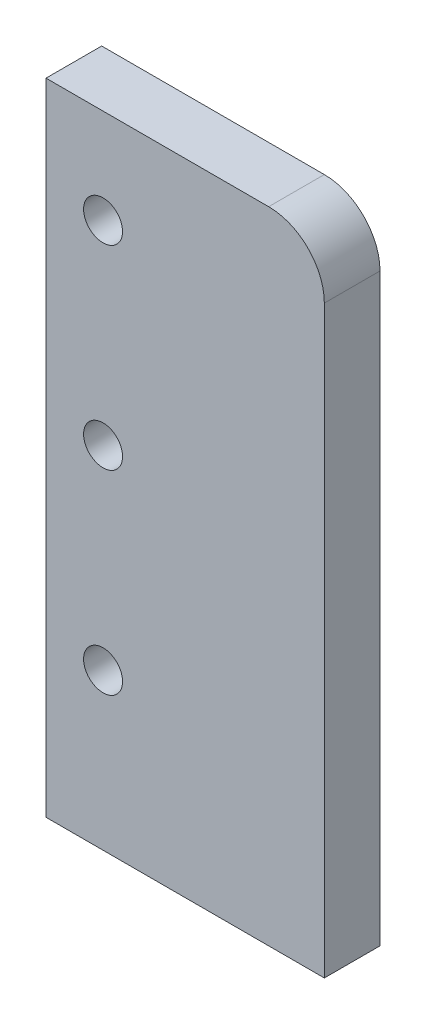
from build123d import *

# Parameters (mm, degrees)
EXTRUSION1_DEPTH           = 20
TROU_TARAUD_M16X2_01_D     = 14
TROU_TARAUD_M16X2_01_DEPTH = 30
TROU_TARAUD_M16X2_01_TIP   = 4.206024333


with BuildPart() as part:
    # Esquisse1 → Extrusion1 (new body)
    with BuildSketch(Plane.XY):
        with BuildLine():
            Line((0, 0), (100, 0))
            Line((100, 0), (100, 210))
            ThreePointArc((100, 210), (94.142135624, 224.142135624), (80, 230))
            Line((80, 230), (0, 230))
            Line((0, 230), (0, 0))
        make_face()
    extrude(amount=EXTRUSION1_DEPTH)

    # Trou taraud_ M16x2.01
    with Locations(Plane(origin=(20.5, 56, 20), x_dir=(1, 0, 0), z_dir=(0, 0, 1))):
        with Locations((0, 0), (0, 70), (0, 140)):
            Hole(TROU_TARAUD_M16X2_01_D / 2, depth=TROU_TARAUD_M16X2_01_DEPTH)
            with Locations((0, 0, -(TROU_TARAUD_M16X2_01_DEPTH + TROU_TARAUD_M16X2_01_TIP / 2))):  # 118° drill point
                Cone(0, TROU_TARAUD_M16X2_01_D / 2, TROU_TARAUD_M16X2_01_TIP, mode=Mode.SUBTRACT)


solid = part.part
